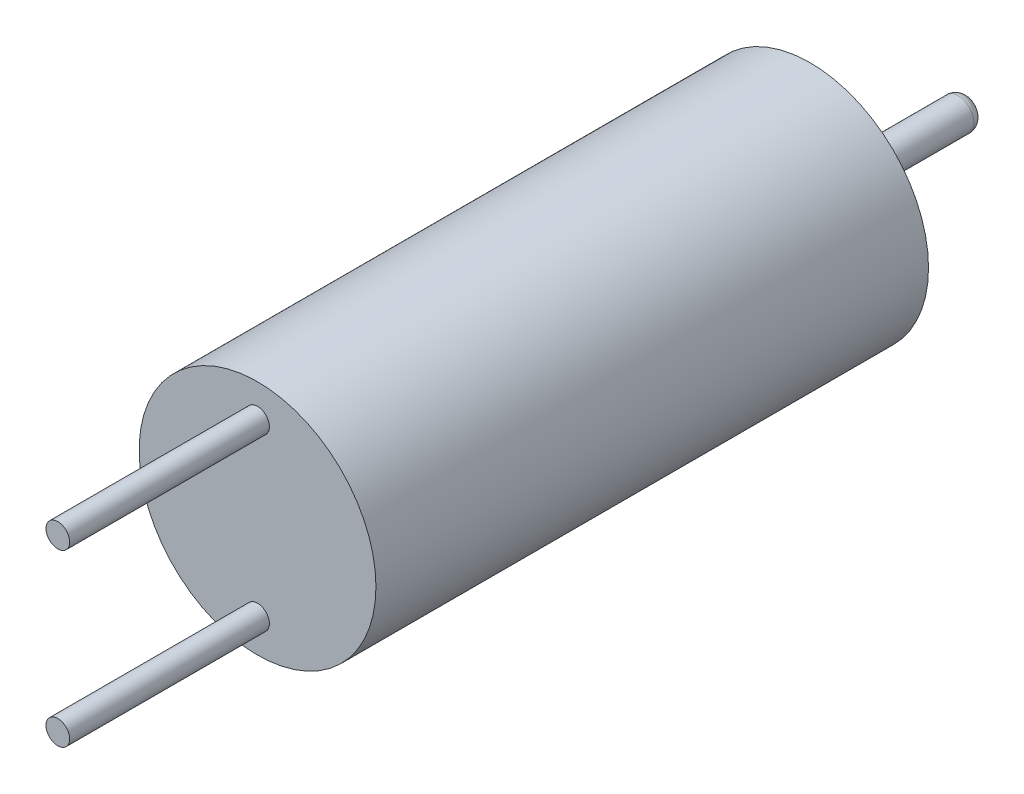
ISO-10303-21;
HEADER;
FILE_DESCRIPTION(('STEP AP214'),'2;1');
FILE_NAME('part.step','',(''),(''),'','','');
FILE_SCHEMA(('AUTOMOTIVE_DESIGN { 1 0 10303 214 1 1 1 1 }'));
ENDSEC;
DATA;
#1=APPLICATION_CONTEXT('core data for automotive mechanical design processes');
#2=APPLICATION_PROTOCOL_DEFINITION('international standard','automotive_design',2000,#1);
#3=PRODUCT_CONTEXT('',#1,'mechanical');
#4=PRODUCT('Part','Part','',(#3));
#5=PRODUCT_RELATED_PRODUCT_CATEGORY('part','',(#4));
#6=PRODUCT_DEFINITION_FORMATION('','',#4);
#7=PRODUCT_DEFINITION_CONTEXT('part definition',#1,'design');
#8=PRODUCT_DEFINITION('design','',#6,#7);
#9=PRODUCT_DEFINITION_SHAPE('','',#8);
#10=(LENGTH_UNIT() NAMED_UNIT(*) SI_UNIT(.MILLI.,.METRE.));
#11=(NAMED_UNIT(*) PLANE_ANGLE_UNIT() SI_UNIT($,.RADIAN.));
#12=(NAMED_UNIT(*) SI_UNIT($,.STERADIAN.) SOLID_ANGLE_UNIT());
#13=UNCERTAINTY_MEASURE_WITH_UNIT(LENGTH_MEASURE(1.E-05),#10,'distance_accuracy_value','');
#14=(GEOMETRIC_REPRESENTATION_CONTEXT(3) GLOBAL_UNCERTAINTY_ASSIGNED_CONTEXT((#13)) GLOBAL_UNIT_ASSIGNED_CONTEXT((#10,
#11,#12)) REPRESENTATION_CONTEXT('',''));
#15=CARTESIAN_POINT('',(0.,0.,0.));
#16=DIRECTION('',(0.,0.,1.));
#17=DIRECTION('',(1.,0.,0.));
#18=AXIS2_PLACEMENT_3D('',#15,#16,#17);
#19=CARTESIAN_POINT('',(0.,0.,10.9));
#20=DIRECTION('',(0.,0.,-1.));
#21=DIRECTION('',(-1.,0.,0.));
#22=AXIS2_PLACEMENT_3D('',#19,#20,#21);
#23=PLANE('',#22);
#24=CARTESIAN_POINT('',(0.,0.,10.9));
#25=DIRECTION('',(0.,0.,-1.));
#26=DIRECTION('',(-1.,0.,0.));
#27=AXIS2_PLACEMENT_3D('',#24,#25,#26);
#28=CIRCLE('',#27,1.);
#29=CARTESIAN_POINT('',(-1.,0.,10.9));
#30=VERTEX_POINT('',#29);
#31=EDGE_CURVE('E58',#30,#30,#28,.T.);
#32=ORIENTED_EDGE('',*,*,#31,.T.);
#33=EDGE_LOOP('',(#32));
#34=FACE_BOUND('',#33,.T.);
#35=CARTESIAN_POINT('',(0.,0.,10.9));
#36=DIRECTION('',(0.,0.,-1.));
#37=DIRECTION('',(-1.,0.,0.));
#38=AXIS2_PLACEMENT_3D('',#35,#36,#37);
#39=CIRCLE('',#38,0.4);
#40=CARTESIAN_POINT('',(-0.4,0.,10.9));
#41=VERTEX_POINT('',#40);
#42=EDGE_CURVE('E62',#41,#41,#39,.T.);
#43=ORIENTED_EDGE('',*,*,#42,.F.);
#44=EDGE_LOOP('',(#43));
#45=FACE_BOUND('',#44,.T.);
#46=ADVANCED_FACE('F32',(#34,#45),#23,.T.);
#47=CARTESIAN_POINT('',(3.,0.,11.2));
#48=DIRECTION('',(0.,0.,-1.));
#49=DIRECTION('',(-1.,0.,0.));
#50=AXIS2_PLACEMENT_3D('',#47,#48,#49);
#51=PLANE('',#50);
#52=CARTESIAN_POINT('',(0.,0.,11.2));
#53=DIRECTION('',(0.,0.,1.));
#54=DIRECTION('',(1.,0.,0.));
#55=AXIS2_PLACEMENT_3D('',#52,#53,#54);
#56=CIRCLE('',#55,3.);
#57=CARTESIAN_POINT('',(3.,0.,11.2));
#58=VERTEX_POINT('',#57);
#59=EDGE_CURVE('E52',#58,#58,#56,.T.);
#60=ORIENTED_EDGE('',*,*,#59,.F.);
#61=EDGE_LOOP('',(#60));
#62=FACE_BOUND('',#61,.T.);
#63=CARTESIAN_POINT('',(0.,0.,11.2));
#64=DIRECTION('',(0.,0.,-1.));
#65=DIRECTION('',(-1.,0.,0.));
#66=AXIS2_PLACEMENT_3D('',#63,#64,#65);
#67=CIRCLE('',#66,1.);
#68=CARTESIAN_POINT('',(-1.,0.,11.2));
#69=VERTEX_POINT('',#68);
#70=EDGE_CURVE('E59',#69,#69,#67,.T.);
#71=ORIENTED_EDGE('',*,*,#70,.F.);
#72=EDGE_LOOP('',(#71));
#73=FACE_BOUND('',#72,.T.);
#74=ADVANCED_FACE('F90',(#62,#73),#51,.T.);
#75=CARTESIAN_POINT('',(0.,0.,11.2));
#76=DIRECTION('',(0.,0.,1.));
#77=DIRECTION('',(1.,0.,0.));
#78=AXIS2_PLACEMENT_3D('',#75,#76,#77);
#79=CYLINDRICAL_SURFACE('',#78,3.);
#80=ORIENTED_EDGE('',*,*,#59,.T.);
#81=EDGE_LOOP('',(#80));
#82=FACE_BOUND('',#81,.T.);
#83=CARTESIAN_POINT('',(0.,0.,25.2));
#84=DIRECTION('',(0.,0.,1.));
#85=DIRECTION('',(1.,0.,0.));
#86=AXIS2_PLACEMENT_3D('',#83,#84,#85);
#87=CIRCLE('',#86,3.);
#88=CARTESIAN_POINT('',(3.,0.,25.2));
#89=VERTEX_POINT('',#88);
#90=EDGE_CURVE('E55',#89,#89,#87,.T.);
#91=ORIENTED_EDGE('',*,*,#90,.F.);
#92=EDGE_LOOP('',(#91));
#93=FACE_BOUND('',#92,.T.);
#94=ADVANCED_FACE('F96',(#82,#93),#79,.T.);
#95=CARTESIAN_POINT('',(0.,0.,25.2));
#96=DIRECTION('',(0.,0.,1.));
#97=DIRECTION('',(1.,0.,0.));
#98=AXIS2_PLACEMENT_3D('',#95,#96,#97);
#99=PLANE('',#98);
#100=CARTESIAN_POINT('',(0.,2.16,25.2));
#101=DIRECTION('',(0.,0.,1.));
#102=DIRECTION('',(1.,0.,0.));
#103=AXIS2_PLACEMENT_3D('',#100,#101,#102);
#104=CIRCLE('',#103,0.3);
#105=CARTESIAN_POINT('',(0.3,2.16,25.2));
#106=VERTEX_POINT('',#105);
#107=EDGE_CURVE('E43',#106,#106,#104,.T.);
#108=ORIENTED_EDGE('',*,*,#107,.F.);
#109=EDGE_LOOP('',(#108));
#110=FACE_BOUND('',#109,.T.);
#111=CARTESIAN_POINT('',(0.,-2.16,25.2));
#112=DIRECTION('',(0.,0.,1.));
#113=DIRECTION('',(1.,0.,0.));
#114=AXIS2_PLACEMENT_3D('',#111,#112,#113);
#115=CIRCLE('',#114,0.3);
#116=CARTESIAN_POINT('',(0.3,-2.16,25.2));
#117=VERTEX_POINT('',#116);
#118=EDGE_CURVE('E47',#117,#117,#115,.T.);
#119=ORIENTED_EDGE('',*,*,#118,.F.);
#120=EDGE_LOOP('',(#119));
#121=FACE_BOUND('',#120,.T.);
#122=ORIENTED_EDGE('',*,*,#90,.T.);
#123=EDGE_LOOP('',(#122));
#124=FACE_BOUND('',#123,.T.);
#125=ADVANCED_FACE('F107',(#110,#121,#124),#99,.T.);
#126=CARTESIAN_POINT('',(0.,0.,10.9));
#127=DIRECTION('',(0.,0.,1.));
#128=DIRECTION('',(1.,0.,0.));
#129=AXIS2_PLACEMENT_3D('',#126,#127,#128);
#130=CYLINDRICAL_SURFACE('',#129,1.);
#131=ORIENTED_EDGE('',*,*,#31,.F.);
#132=EDGE_LOOP('',(#131));
#133=FACE_BOUND('',#132,.T.);
#134=ORIENTED_EDGE('',*,*,#70,.T.);
#135=EDGE_LOOP('',(#134));
#136=FACE_BOUND('',#135,.T.);
#137=ADVANCED_FACE('F104',(#133,#136),#130,.T.);
#138=CARTESIAN_POINT('',(0.,0.,7.2));
#139=DIRECTION('',(0.,0.,1.));
#140=DIRECTION('',(1.,0.,0.));
#141=AXIS2_PLACEMENT_3D('',#138,#139,#140);
#142=CYLINDRICAL_SURFACE('',#141,0.4);
#143=CARTESIAN_POINT('',(0.,0.,7.44999999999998));
#144=DIRECTION('',(0.,0.,-1.));
#145=DIRECTION('',(-1.,0.,0.));
#146=AXIS2_PLACEMENT_3D('',#143,#144,#145);
#147=CIRCLE('',#146,0.4);
#148=CARTESIAN_POINT('',(-0.4,0.,7.44999999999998));
#149=VERTEX_POINT('',#148);
#150=EDGE_CURVE('E10',#149,#149,#147,.F.);
#151=ORIENTED_EDGE('',*,*,#150,.T.);
#152=EDGE_LOOP('',(#151));
#153=FACE_BOUND('',#152,.T.);
#154=ORIENTED_EDGE('',*,*,#42,.T.);
#155=EDGE_LOOP('',(#154));
#156=FACE_BOUND('',#155,.T.);
#157=ADVANCED_FACE('F102',(#153,#156),#142,.T.);
#158=CARTESIAN_POINT('',(0.,0.,7.2));
#159=DIRECTION('',(0.,0.,-1.));
#160=DIRECTION('',(-1.,0.,0.));
#161=AXIS2_PLACEMENT_3D('',#158,#159,#160);
#162=PLANE('',#161);
#163=CARTESIAN_POINT('',(0.,0.,7.2));
#164=DIRECTION('',(0.,0.,-1.));
#165=DIRECTION('',(-1.,0.,0.));
#166=AXIS2_PLACEMENT_3D('',#163,#164,#165);
#167=CIRCLE('',#166,0.150000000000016);
#168=CARTESIAN_POINT('',(-0.150000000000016,0.,7.2));
#169=VERTEX_POINT('',#168);
#170=EDGE_CURVE('E39',#169,#169,#167,.T.);
#171=ORIENTED_EDGE('',*,*,#170,.T.);
#172=EDGE_LOOP('',(#171));
#173=FACE_BOUND('',#172,.T.);
#174=ADVANCED_FACE('F139',(#173),#162,.T.);
#175=CARTESIAN_POINT('',(0.,-2.16,25.2));
#176=DIRECTION('',(0.,0.,1.));
#177=DIRECTION('',(1.,0.,0.));
#178=AXIS2_PLACEMENT_3D('',#175,#176,#177);
#179=CYLINDRICAL_SURFACE('',#178,0.3);
#180=ORIENTED_EDGE('',*,*,#118,.T.);
#181=EDGE_LOOP('',(#180));
#182=FACE_BOUND('',#181,.T.);
#183=CARTESIAN_POINT('',(0.,-2.16,30.26));
#184=DIRECTION('',(0.,0.,1.));
#185=DIRECTION('',(1.,0.,0.));
#186=AXIS2_PLACEMENT_3D('',#183,#184,#185);
#187=CIRCLE('',#186,0.3);
#188=CARTESIAN_POINT('',(0.3,-2.16,30.26));
#189=VERTEX_POINT('',#188);
#190=EDGE_CURVE('E67',#189,#189,#187,.T.);
#191=ORIENTED_EDGE('',*,*,#190,.F.);
#192=EDGE_LOOP('',(#191));
#193=FACE_BOUND('',#192,.T.);
#194=ADVANCED_FACE('F86',(#182,#193),#179,.T.);
#195=CARTESIAN_POINT('',(0.,-2.16,30.26));
#196=DIRECTION('',(0.,0.,1.));
#197=DIRECTION('',(1.,0.,0.));
#198=AXIS2_PLACEMENT_3D('',#195,#196,#197);
#199=PLANE('',#198);
#200=ORIENTED_EDGE('',*,*,#190,.T.);
#201=EDGE_LOOP('',(#200));
#202=FACE_BOUND('',#201,.T.);
#203=ADVANCED_FACE('F78',(#202),#199,.T.);
#204=CARTESIAN_POINT('',(0.,2.16,25.2));
#205=DIRECTION('',(0.,0.,1.));
#206=DIRECTION('',(1.,0.,0.));
#207=AXIS2_PLACEMENT_3D('',#204,#205,#206);
#208=CYLINDRICAL_SURFACE('',#207,0.3);
#209=ORIENTED_EDGE('',*,*,#107,.T.);
#210=EDGE_LOOP('',(#209));
#211=FACE_BOUND('',#210,.T.);
#212=CARTESIAN_POINT('',(0.,2.16,30.26));
#213=DIRECTION('',(0.,0.,1.));
#214=DIRECTION('',(1.,0.,0.));
#215=AXIS2_PLACEMENT_3D('',#212,#213,#214);
#216=CIRCLE('',#215,0.3);
#217=CARTESIAN_POINT('',(0.3,2.16,30.26));
#218=VERTEX_POINT('',#217);
#219=EDGE_CURVE('E70',#218,#218,#216,.T.);
#220=ORIENTED_EDGE('',*,*,#219,.F.);
#221=EDGE_LOOP('',(#220));
#222=FACE_BOUND('',#221,.T.);
#223=ADVANCED_FACE('F76',(#211,#222),#208,.T.);
#224=CARTESIAN_POINT('',(0.,2.16,30.26));
#225=DIRECTION('',(0.,0.,1.));
#226=DIRECTION('',(1.,0.,0.));
#227=AXIS2_PLACEMENT_3D('',#224,#225,#226);
#228=PLANE('',#227);
#229=ORIENTED_EDGE('',*,*,#219,.T.);
#230=EDGE_LOOP('',(#229));
#231=FACE_BOUND('',#230,.T.);
#232=ADVANCED_FACE('F74',(#231),#228,.T.);
#233=CARTESIAN_POINT('',(0.,0.,7.44999999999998));
#234=DIRECTION('',(0.,0.,-1.));
#235=DIRECTION('',(-1.,0.,0.));
#236=AXIS2_PLACEMENT_3D('',#233,#234,#235);
#237=DEGENERATE_TOROIDAL_SURFACE('',#236,0.150000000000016,0.249999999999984,.T.);
#238=ORIENTED_EDGE('',*,*,#150,.F.);
#239=EDGE_LOOP('',(#238));
#240=FACE_BOUND('',#239,.T.);
#241=ORIENTED_EDGE('',*,*,#170,.F.);
#242=EDGE_LOOP('',(#241));
#243=FACE_BOUND('',#242,.T.);
#244=ADVANCED_FACE('F34',(#240,#243),#237,.T.);
#245=CLOSED_SHELL('',(#46,#74,#94,#125,#137,#157,#174,#194,#203,#223,#232,#244));
#246=MANIFOLD_SOLID_BREP('B2',#245);
#247=ADVANCED_BREP_SHAPE_REPRESENTATION('',(#18,#246),#14);
#248=SHAPE_DEFINITION_REPRESENTATION(#9,#247);
ENDSEC;
END-ISO-10303-21;
